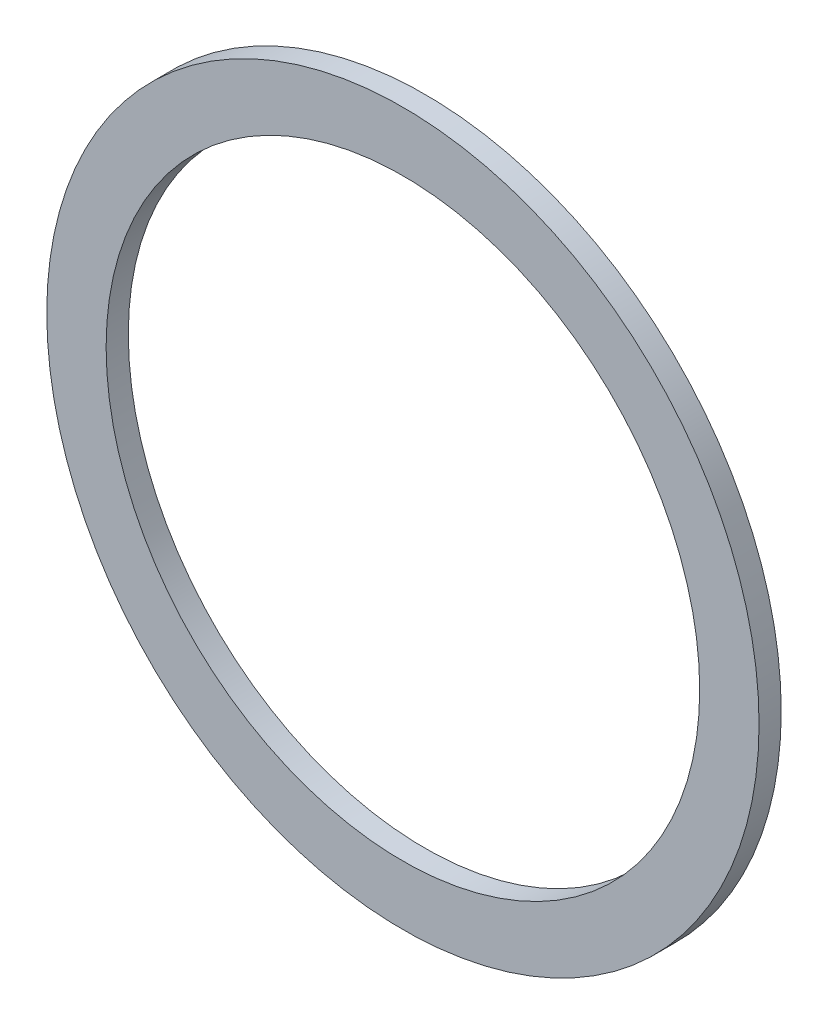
from build123d import *

# Parameters (mm, degrees)
SKETCH1_R      = 12.6492
SKETCH1_R_2    = 10.541
EXTRUDE1_DEPTH = 0.7874


with BuildPart() as part:
    # Sketch1 → Extrude1 (new body)
    with BuildSketch(Plane.XY):
        Circle(SKETCH1_R)
        Circle(SKETCH1_R_2, mode=Mode.SUBTRACT)
    extrude(amount=EXTRUDE1_DEPTH)


solid = part.part
